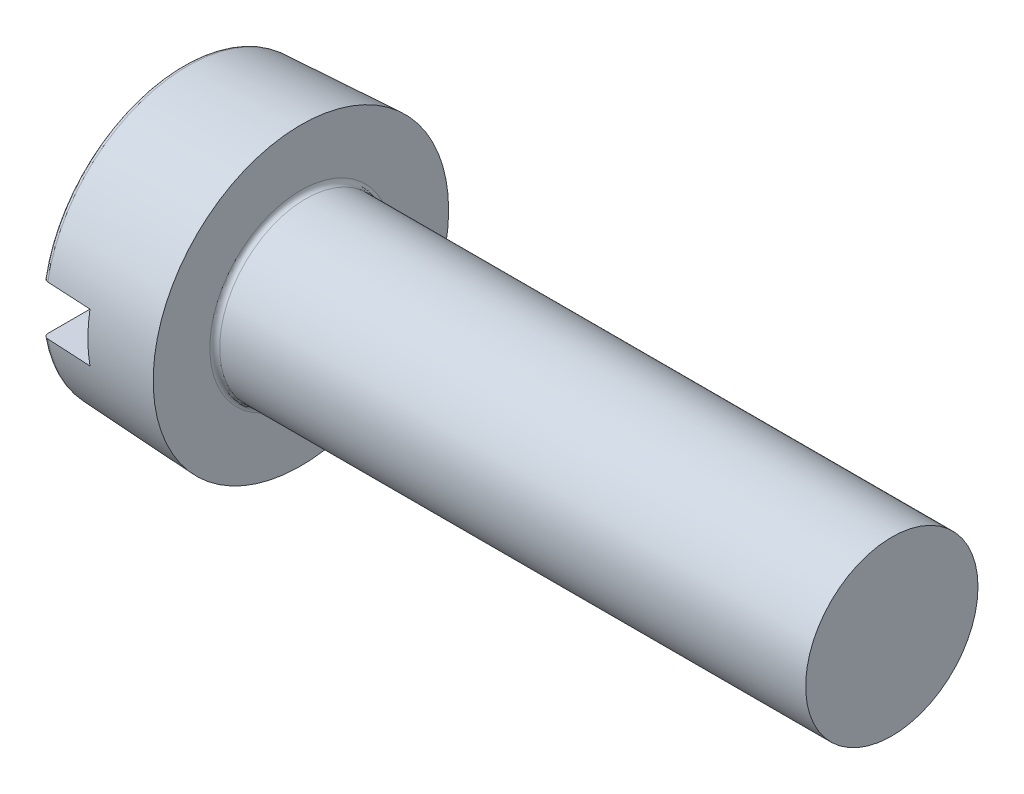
ISO-10303-21;
HEADER;
FILE_DESCRIPTION(('STEP AP214'),'2;1');
FILE_NAME('part.step','',(''),(''),'','','');
FILE_SCHEMA(('AUTOMOTIVE_DESIGN { 1 0 10303 214 1 1 1 1 }'));
ENDSEC;
DATA;
#1=APPLICATION_CONTEXT('core data for automotive mechanical design processes');
#2=APPLICATION_PROTOCOL_DEFINITION('international standard','automotive_design',2000,#1);
#3=PRODUCT_CONTEXT('',#1,'mechanical');
#4=PRODUCT('Part','Part','',(#3));
#5=PRODUCT_RELATED_PRODUCT_CATEGORY('part','',(#4));
#6=PRODUCT_DEFINITION_FORMATION('','',#4);
#7=PRODUCT_DEFINITION_CONTEXT('part definition',#1,'design');
#8=PRODUCT_DEFINITION('design','',#6,#7);
#9=PRODUCT_DEFINITION_SHAPE('','',#8);
#10=(LENGTH_UNIT() NAMED_UNIT(*) SI_UNIT(.MILLI.,.METRE.));
#11=(NAMED_UNIT(*) PLANE_ANGLE_UNIT() SI_UNIT($,.RADIAN.));
#12=(NAMED_UNIT(*) SI_UNIT($,.STERADIAN.) SOLID_ANGLE_UNIT());
#13=UNCERTAINTY_MEASURE_WITH_UNIT(LENGTH_MEASURE(1.E-05),#10,'distance_accuracy_value','');
#14=(GEOMETRIC_REPRESENTATION_CONTEXT(3) GLOBAL_UNCERTAINTY_ASSIGNED_CONTEXT((#13)) GLOBAL_UNIT_ASSIGNED_CONTEXT((#10,
#11,#12)) REPRESENTATION_CONTEXT('',''));
#15=CARTESIAN_POINT('',(0.,0.,0.));
#16=DIRECTION('',(0.,0.,1.));
#17=DIRECTION('',(1.,0.,0.));
#18=AXIS2_PLACEMENT_3D('',#15,#16,#17);
#19=CARTESIAN_POINT('',(0.,0.,0.));
#20=DIRECTION('',(1.,0.,0.));
#21=DIRECTION('',(0.,0.,-1.));
#22=AXIS2_PLACEMENT_3D('',#19,#20,#21);
#23=PLANE('',#22);
#24=DIRECTION('',(0.,0.,-1.));
#25=VECTOR('',#24,1.);
#26=CARTESIAN_POINT('',(0.,-0.5,0.));
#27=LINE('',#26,#25);
#28=CARTESIAN_POINT('',(0.,-0.5,2.7339800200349));
#29=VERTEX_POINT('',#28);
#30=CARTESIAN_POINT('',(0.,-0.5,-2.7339800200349));
#31=VERTEX_POINT('',#30);
#32=EDGE_CURVE('E117',#29,#31,#27,.T.);
#33=ORIENTED_EDGE('',*,*,#32,.T.);
#34=CARTESIAN_POINT('',(0.,0.,0.));
#35=DIRECTION('',(1.,0.,0.));
#36=DIRECTION('',(0.,0.,-1.));
#37=AXIS2_PLACEMENT_3D('',#34,#35,#36);
#38=CIRCLE('',#37,2.77932487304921);
#39=EDGE_CURVE('E199',#31,#29,#38,.F.);
#40=ORIENTED_EDGE('',*,*,#39,.T.);
#41=EDGE_LOOP('',(#33,#40));
#42=FACE_BOUND('',#41,.T.);
#43=ADVANCED_FACE('F37',(#42),#23,.F.);
#44=CARTESIAN_POINT('',(2.4,0.,0.));
#45=DIRECTION('',(1.,0.,0.));
#46=DIRECTION('',(0.,0.,-1.));
#47=AXIS2_PLACEMENT_3D('',#44,#45,#46);
#48=PLANE('',#47);
#49=CARTESIAN_POINT('',(2.4,0.,0.));
#50=DIRECTION('',(1.,0.,0.));
#51=DIRECTION('',(0.,0.,-1.));
#52=AXIS2_PLACEMENT_3D('',#49,#50,#51);
#53=CIRCLE('',#52,1.85);
#54=CARTESIAN_POINT('',(2.4,0.,-1.85));
#55=VERTEX_POINT('',#54);
#56=EDGE_CURVE('E127',#55,#55,#53,.F.);
#57=ORIENTED_EDGE('',*,*,#56,.T.);
#58=EDGE_LOOP('',(#57));
#59=FACE_BOUND('',#58,.T.);
#60=CARTESIAN_POINT('',(2.4,0.,0.));
#61=DIRECTION('',(1.,0.,0.));
#62=DIRECTION('',(0.,0.,-1.));
#63=AXIS2_PLACEMENT_3D('',#60,#61,#62);
#64=CIRCLE('',#63,3.);
#65=CARTESIAN_POINT('',(2.4,0.,-3.));
#66=VERTEX_POINT('',#65);
#67=EDGE_CURVE('E225',#66,#66,#64,.T.);
#68=ORIENTED_EDGE('',*,*,#67,.T.);
#69=EDGE_LOOP('',(#68));
#70=FACE_BOUND('',#69,.T.);
#71=ADVANCED_FACE('F176',(#59,#70),#48,.T.);
#72=CARTESIAN_POINT('',(2.4,0.,0.));
#73=DIRECTION('',(1.,0.,0.));
#74=DIRECTION('',(0.,0.,-1.));
#75=AXIS2_PLACEMENT_3D('',#72,#73,#74);
#76=CONICAL_SURFACE('',#75,3.,0.05235987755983);
#77=CARTESIAN_POINT('',(-5.03379648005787,-0.500000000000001,2.56207861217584));
#78=CARTESIAN_POINT('',(-3.20003342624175,-0.500000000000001,2.65996062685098));
#79=CARTESIAN_POINT('',(-1.36626239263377,-0.5,2.75769268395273));
#80=CARTESIAN_POINT('',(2.30129563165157,-0.499999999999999,2.95285688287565));
#81=CARTESIAN_POINT('',(4.13508262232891,-0.499999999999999,3.05028902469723));
#82=CARTESIAN_POINT('',(5.96887759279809,-0.499999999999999,3.14757120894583));
#83=B_SPLINE_CURVE_WITH_KNOTS('',3,(#77,#78,#79,#80,#81,#82),.UNSPECIFIED.,.F.,.F.,(4,2,4),(0.,
5.50912060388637,11.018241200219),.UNSPECIFIED.);
#84=CARTESIAN_POINT('',(0.0947664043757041,-0.5,2.83544044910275));
#85=VERTEX_POINT('',#84);
#86=CARTESIAN_POINT('',(1.,-0.5,2.88360155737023));
#87=VERTEX_POINT('',#86);
#88=EDGE_CURVE('E98',#85,#87,#83,.T.);
#89=ORIENTED_EDGE('',*,*,#88,.F.);
#90=CARTESIAN_POINT('',(0.0947664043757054,0.,0.));
#91=DIRECTION('',(1.,0.,0.));
#92=DIRECTION('',(0.,0.,-1.));
#93=AXIS2_PLACEMENT_3D('',#90,#91,#92);
#94=CIRCLE('',#93,2.87918782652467);
#95=CARTESIAN_POINT('',(0.0947664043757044,-0.5,-2.83544044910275));
#96=VERTEX_POINT('',#95);
#97=EDGE_CURVE('E132',#85,#96,#94,.T.);
#98=ORIENTED_EDGE('',*,*,#97,.T.);
#99=CARTESIAN_POINT('',(5.96887759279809,-0.499999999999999,-3.14757120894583));
#100=CARTESIAN_POINT('',(4.13508262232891,-0.499999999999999,-3.05028902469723));
#101=CARTESIAN_POINT('',(2.30129563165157,-0.499999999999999,-2.95285688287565));
#102=CARTESIAN_POINT('',(-1.36626239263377,-0.5,-2.75769268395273));
#103=CARTESIAN_POINT('',(-3.20003342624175,-0.500000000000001,-2.65996062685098));
#104=CARTESIAN_POINT('',(-5.03379648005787,-0.500000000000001,-2.56207861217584));
#105=B_SPLINE_CURVE_WITH_KNOTS('',3,(#99,#100,#101,#102,#103,#104),.UNSPECIFIED.,.F.,.F.,(4,2,
4),(0.,5.50912059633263,11.018241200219),.UNSPECIFIED.);
#106=CARTESIAN_POINT('',(1.,-0.5,-2.88360155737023));
#107=VERTEX_POINT('',#106);
#108=EDGE_CURVE('E116',#107,#96,#105,.T.);
#109=ORIENTED_EDGE('',*,*,#108,.F.);
#110=CARTESIAN_POINT('',(1.,0.,0.));
#111=DIRECTION('',(1.,0.,0.));
#112=DIRECTION('',(0.,0.,-1.));
#113=AXIS2_PLACEMENT_3D('',#110,#111,#112);
#114=CIRCLE('',#113,2.92662910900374);
#115=CARTESIAN_POINT('',(1.,0.5,-2.88360155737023));
#116=VERTEX_POINT('',#115);
#117=EDGE_CURVE('E104',#116,#107,#114,.F.);
#118=ORIENTED_EDGE('',*,*,#117,.F.);
#119=CARTESIAN_POINT('',(-5.03379648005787,0.499999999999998,-2.56207861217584));
#120=CARTESIAN_POINT('',(-3.20003342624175,0.499999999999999,-2.65996062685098));
#121=CARTESIAN_POINT('',(-1.36626239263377,0.499999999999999,-2.75769268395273));
#122=CARTESIAN_POINT('',(2.30129563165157,0.500000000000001,-2.95285688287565));
#123=CARTESIAN_POINT('',(4.13508262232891,0.500000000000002,-3.05028902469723));
#124=CARTESIAN_POINT('',(5.96887759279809,0.500000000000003,-3.14757120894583));
#125=B_SPLINE_CURVE_WITH_KNOTS('',3,(#119,#120,#121,#122,#123,#124),.UNSPECIFIED.,.F.,.F.,(4,2,
4),(0.,5.50912060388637,11.018241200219),.UNSPECIFIED.);
#126=CARTESIAN_POINT('',(0.0947664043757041,0.5,-2.83544044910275));
#127=VERTEX_POINT('',#126);
#128=EDGE_CURVE('E87',#127,#116,#125,.T.);
#129=ORIENTED_EDGE('',*,*,#128,.F.);
#130=CARTESIAN_POINT('',(0.0947664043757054,0.,0.));
#131=DIRECTION('',(1.,0.,0.));
#132=DIRECTION('',(0.,0.,-1.));
#133=AXIS2_PLACEMENT_3D('',#130,#131,#132);
#134=CIRCLE('',#133,2.87918782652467);
#135=CARTESIAN_POINT('',(0.0947664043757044,0.5,2.83544044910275));
#136=VERTEX_POINT('',#135);
#137=EDGE_CURVE('E130',#127,#136,#134,.T.);
#138=ORIENTED_EDGE('',*,*,#137,.T.);
#139=CARTESIAN_POINT('',(5.96887759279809,0.500000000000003,3.14757120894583));
#140=CARTESIAN_POINT('',(4.13508262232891,0.500000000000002,3.05028902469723));
#141=CARTESIAN_POINT('',(2.30129563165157,0.500000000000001,2.95285688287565));
#142=CARTESIAN_POINT('',(-1.36626239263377,0.499999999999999,2.75769268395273));
#143=CARTESIAN_POINT('',(-3.20003342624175,0.499999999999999,2.65996062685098));
#144=CARTESIAN_POINT('',(-5.03379648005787,0.499999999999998,2.56207861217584));
#145=B_SPLINE_CURVE_WITH_KNOTS('',3,(#139,#140,#141,#142,#143,#144),.UNSPECIFIED.,.F.,.F.,(4,2,
4),(0.,5.50912059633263,11.018241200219),.UNSPECIFIED.);
#146=CARTESIAN_POINT('',(1.,0.5,2.88360155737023));
#147=VERTEX_POINT('',#146);
#148=EDGE_CURVE('E99',#147,#136,#145,.T.);
#149=ORIENTED_EDGE('',*,*,#148,.F.);
#150=EDGE_CURVE('E107',#87,#147,#114,.F.);
#151=ORIENTED_EDGE('',*,*,#150,.F.);
#152=EDGE_LOOP('',(#89,#98,#109,#118,#129,#138,#149,#151));
#153=FACE_BOUND('',#152,.T.);
#154=ORIENTED_EDGE('',*,*,#67,.F.);
#155=EDGE_LOOP('',(#154));
#156=FACE_BOUND('',#155,.T.);
#157=ADVANCED_FACE('F112',(#153,#156),#76,.T.);
#158=DIRECTION('',(0.,0.,1.));
#159=VECTOR('',#158,1.);
#160=CARTESIAN_POINT('',(0.,0.5,0.));
#161=LINE('',#160,#159);
#162=CARTESIAN_POINT('',(0.,0.5,-2.7339800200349));
#163=VERTEX_POINT('',#162);
#164=CARTESIAN_POINT('',(0.,0.5,2.7339800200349));
#165=VERTEX_POINT('',#164);
#166=EDGE_CURVE('E121',#163,#165,#161,.T.);
#167=ORIENTED_EDGE('',*,*,#166,.T.);
#168=CARTESIAN_POINT('',(0.,0.,0.));
#169=DIRECTION('',(1.,0.,0.));
#170=DIRECTION('',(0.,0.,-1.));
#171=AXIS2_PLACEMENT_3D('',#168,#169,#170);
#172=CIRCLE('',#171,2.77932487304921);
#173=EDGE_CURVE('E11',#165,#163,#172,.F.);
#174=ORIENTED_EDGE('',*,*,#173,.T.);
#175=EDGE_LOOP('',(#167,#174));
#176=FACE_BOUND('',#175,.T.);
#177=ADVANCED_FACE('F175',(#176),#23,.F.);
#178=CARTESIAN_POINT('',(14.3999999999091,0.,0.));
#179=DIRECTION('',(-1.,0.,0.));
#180=DIRECTION('',(0.,0.,1.));
#181=AXIS2_PLACEMENT_3D('',#178,#179,#180);
#182=CYLINDRICAL_SURFACE('',#181,1.75);
#183=CARTESIAN_POINT('',(2.5,0.,0.));
#184=DIRECTION('',(1.,0.,0.));
#185=DIRECTION('',(0.,0.,-1.));
#186=AXIS2_PLACEMENT_3D('',#183,#184,#185);
#187=CIRCLE('',#186,1.75);
#188=CARTESIAN_POINT('',(2.5,0.,-1.75));
#189=VERTEX_POINT('',#188);
#190=EDGE_CURVE('E119',#189,#189,#187,.T.);
#191=ORIENTED_EDGE('',*,*,#190,.T.);
#192=EDGE_LOOP('',(#191));
#193=FACE_BOUND('',#192,.T.);
#194=CARTESIAN_POINT('',(14.3999999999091,0.,0.));
#195=DIRECTION('',(1.,0.,0.));
#196=DIRECTION('',(0.,0.,-1.));
#197=AXIS2_PLACEMENT_3D('',#194,#195,#196);
#198=CIRCLE('',#197,1.75);
#199=CARTESIAN_POINT('',(14.3999999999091,0.,-1.75));
#200=VERTEX_POINT('',#199);
#201=EDGE_CURVE('E170',#200,#200,#198,.T.);
#202=ORIENTED_EDGE('',*,*,#201,.F.);
#203=EDGE_LOOP('',(#202));
#204=FACE_BOUND('',#203,.T.);
#205=ADVANCED_FACE('F220',(#193,#204),#182,.T.);
#206=CARTESIAN_POINT('',(14.3999999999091,0.,0.));
#207=DIRECTION('',(1.,0.,0.));
#208=DIRECTION('',(0.,0.,-1.));
#209=AXIS2_PLACEMENT_3D('',#206,#207,#208);
#210=PLANE('',#209);
#211=ORIENTED_EDGE('',*,*,#201,.T.);
#212=EDGE_LOOP('',(#211));
#213=FACE_BOUND('',#212,.T.);
#214=ADVANCED_FACE('F153',(#213),#210,.T.);
#215=CARTESIAN_POINT('',(0.,-0.5,-3.));
#216=DIRECTION('',(0.,-1.,0.));
#217=DIRECTION('',(1.,0.,0.));
#218=AXIS2_PLACEMENT_3D('',#215,#216,#217);
#219=PLANE('',#218);
#220=ORIENTED_EDGE('',*,*,#108,.T.);
#221=CARTESIAN_POINT('',(0.0947664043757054,-0.5,-2.83544044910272));
#222=CARTESIAN_POINT('',(0.0892037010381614,-0.5,-2.8351495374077));
#223=CARTESIAN_POINT('',(0.0836686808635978,-0.5,-2.83437697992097));
#224=CARTESIAN_POINT('',(0.0728128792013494,-0.5,-2.83191620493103));
#225=CARTESIAN_POINT('',(0.0674918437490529,-0.5,-2.83022910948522));
#226=CARTESIAN_POINT('',(0.057206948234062,-0.5,-2.8259853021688));
#227=CARTESIAN_POINT('',(0.0522431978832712,-0.5,-2.82342832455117));
#228=CARTESIAN_POINT('',(0.0428116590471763,-0.5,-2.81752383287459));
#229=CARTESIAN_POINT('',(0.0383438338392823,-0.5,-2.81417637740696));
#230=CARTESIAN_POINT('',(0.0299931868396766,-0.5,-2.8067617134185));
#231=CARTESIAN_POINT('',(0.0261148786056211,-0.5,-2.80268942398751));
#232=CARTESIAN_POINT('',(0.0190838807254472,-0.5,-2.79395863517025));
#233=CARTESIAN_POINT('',(0.0159314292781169,-0.5,-2.78929994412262));
#234=CARTESIAN_POINT('',(0.0103922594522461,-0.5,-2.77945487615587));
#235=CARTESIAN_POINT('',(0.00801788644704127,-0.5,-2.77426156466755));
#236=CARTESIAN_POINT('',(0.00416302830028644,-0.5,-2.7635554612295));
#237=CARTESIAN_POINT('',(0.00268185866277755,-0.5,-2.75804291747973));
#238=CARTESIAN_POINT('',(0.00111040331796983,-0.5,-2.74940205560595));
#239=CARTESIAN_POINT('',(0.00069391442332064,-0.5,-2.74632955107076));
#240=CARTESIAN_POINT('',(0.000138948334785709,-0.5,-2.74016513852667));
#241=CARTESIAN_POINT('',(-3.07996439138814E-08,-0.5,-2.73707327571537));
#242=CARTESIAN_POINT('',(0.,-0.5,-2.7339800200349));
#243=B_SPLINE_CURVE_WITH_KNOTS('',3,(#221,#222,#223,#224,#225,#226,#227,#228,#229,#230,#231,
#232,#233,#234,#235,#236,#237,#238,#239,#240,#241,#242),.UNSPECIFIED.,.F.,.F.,(4,2,2,2,2,2,2,2,
2,2,4),(0.,0.0166874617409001,0.0333544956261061,0.0500266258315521,0.0666975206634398,
0.0834902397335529,0.100288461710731,0.117341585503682,0.134381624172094,0.14367231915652,
0.152946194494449),.UNSPECIFIED.);
#244=EDGE_CURVE('E140',#96,#31,#243,.T.);
#245=ORIENTED_EDGE('',*,*,#244,.T.);
#246=ORIENTED_EDGE('',*,*,#32,.F.);
#247=CARTESIAN_POINT('',(0.,-0.5,2.7339800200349));
#248=CARTESIAN_POINT('',(-4.48427181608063E-06,-0.5,2.73976430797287));
#249=CARTESIAN_POINT('',(0.00048537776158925,-0.5,2.74554780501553));
#250=CARTESIAN_POINT('',(0.00242211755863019,-0.5,2.75695087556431));
#251=CARTESIAN_POINT('',(0.00386875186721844,-0.5,2.76257049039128));
#252=CARTESIAN_POINT('',(0.00768866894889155,-0.5,2.7734902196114));
#253=CARTESIAN_POINT('',(0.010062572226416,-0.5,2.77879011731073));
#254=CARTESIAN_POINT('',(0.0156724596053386,-0.5,2.78891006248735));
#255=CARTESIAN_POINT('',(0.0189081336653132,-0.5,2.79373028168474));
#256=CARTESIAN_POINT('',(0.026125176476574,-0.5,2.80271206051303));
#257=CARTESIAN_POINT('',(0.030100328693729,-0.5,2.80687861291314));
#258=CARTESIAN_POINT('',(0.0387049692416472,-0.5,2.8144741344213));
#259=CARTESIAN_POINT('',(0.043334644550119,-0.5,2.81790289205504));
#260=CARTESIAN_POINT('',(0.0530411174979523,-0.5,2.82386903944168));
#261=CARTESIAN_POINT('',(0.0581102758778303,-0.5,2.8264188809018));
#262=CARTESIAN_POINT('',(0.0686061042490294,-0.5,2.83061527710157));
#263=CARTESIAN_POINT('',(0.0740323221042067,-0.5,2.8322629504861));
#264=CARTESIAN_POINT('',(0.0820605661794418,-0.5,2.83396630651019));
#265=CARTESIAN_POINT('',(0.0845874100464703,-0.5,2.83440004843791));
#266=CARTESIAN_POINT('',(0.0896628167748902,-0.5,2.83506893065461));
#267=CARTESIAN_POINT('',(0.0922113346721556,-0.5,2.83530441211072));
#268=CARTESIAN_POINT('',(0.0947664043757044,-0.5,2.83544044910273));
#269=B_SPLINE_CURVE_WITH_KNOTS('',3,(#247,#248,#249,#250,#251,#252,#253,#254,#255,#256,#257,
#258,#259,#260,#261,#262,#263,#264,#265,#266,#267,#268),.UNSPECIFIED.,.F.,.F.,(4,2,2,2,2,2,2,2,
2,2,4),(0.,0.017331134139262,0.0346578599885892,0.0519962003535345,0.069328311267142,
0.0865208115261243,0.103718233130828,0.120660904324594,0.137582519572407,0.145267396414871,
0.152939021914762),.UNSPECIFIED.);
#270=EDGE_CURVE('E134',#29,#85,#269,.T.);
#271=ORIENTED_EDGE('',*,*,#270,.T.);
#272=ORIENTED_EDGE('',*,*,#88,.T.);
#273=DIRECTION('',(0.,0.,1.));
#274=VECTOR('',#273,1.);
#275=CARTESIAN_POINT('',(1.,-0.5,-3.));
#276=LINE('',#275,#274);
#277=EDGE_CURVE('E108',#107,#87,#276,.T.);
#278=ORIENTED_EDGE('',*,*,#277,.F.);
#279=EDGE_LOOP('',(#220,#245,#246,#271,#272,#278));
#280=FACE_BOUND('',#279,.T.);
#281=ADVANCED_FACE('F148',(#280),#219,.F.);
#282=CARTESIAN_POINT('',(0.,0.5,-3.));
#283=DIRECTION('',(0.,1.,0.));
#284=DIRECTION('',(-1.,0.,0.));
#285=AXIS2_PLACEMENT_3D('',#282,#283,#284);
#286=PLANE('',#285);
#287=ORIENTED_EDGE('',*,*,#148,.T.);
#288=CARTESIAN_POINT('',(0.0947664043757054,0.5,2.83544044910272));
#289=CARTESIAN_POINT('',(0.0892037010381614,0.5,2.8351495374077));
#290=CARTESIAN_POINT('',(0.0836686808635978,0.5,2.83437697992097));
#291=CARTESIAN_POINT('',(0.0728128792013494,0.5,2.83191620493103));
#292=CARTESIAN_POINT('',(0.0674918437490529,0.5,2.83022910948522));
#293=CARTESIAN_POINT('',(0.057206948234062,0.5,2.8259853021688));
#294=CARTESIAN_POINT('',(0.0522431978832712,0.5,2.82342832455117));
#295=CARTESIAN_POINT('',(0.0428116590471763,0.5,2.81752383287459));
#296=CARTESIAN_POINT('',(0.0383438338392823,0.5,2.81417637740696));
#297=CARTESIAN_POINT('',(0.0299931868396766,0.5,2.8067617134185));
#298=CARTESIAN_POINT('',(0.0261148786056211,0.5,2.80268942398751));
#299=CARTESIAN_POINT('',(0.0190838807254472,0.5,2.79395863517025));
#300=CARTESIAN_POINT('',(0.0159314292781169,0.5,2.78929994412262));
#301=CARTESIAN_POINT('',(0.0103922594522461,0.5,2.77945487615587));
#302=CARTESIAN_POINT('',(0.00801788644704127,0.5,2.77426156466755));
#303=CARTESIAN_POINT('',(0.00416302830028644,0.5,2.7635554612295));
#304=CARTESIAN_POINT('',(0.00268185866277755,0.5,2.75804291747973));
#305=CARTESIAN_POINT('',(0.00111040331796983,0.5,2.74940205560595));
#306=CARTESIAN_POINT('',(0.000693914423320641,0.5,2.74632955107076));
#307=CARTESIAN_POINT('',(0.00013894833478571,0.5,2.74016513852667));
#308=CARTESIAN_POINT('',(-3.07996439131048E-08,0.5,2.73707327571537));
#309=CARTESIAN_POINT('',(0.,0.5,2.7339800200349));
#310=B_SPLINE_CURVE_WITH_KNOTS('',3,(#288,#289,#290,#291,#292,#293,#294,#295,#296,#297,#298,
#299,#300,#301,#302,#303,#304,#305,#306,#307,#308,#309),.UNSPECIFIED.,.F.,.F.,(4,2,2,2,2,2,2,2,
2,2,4),(0.,0.0166874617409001,0.0333544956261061,0.0500266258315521,0.0666975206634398,
0.0834902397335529,0.100288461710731,0.117341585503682,0.134381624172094,0.14367231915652,
0.152946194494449),.UNSPECIFIED.);
#311=EDGE_CURVE('E46',#136,#165,#310,.T.);
#312=ORIENTED_EDGE('',*,*,#311,.T.);
#313=ORIENTED_EDGE('',*,*,#166,.F.);
#314=CARTESIAN_POINT('',(0.,0.5,-2.7339800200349));
#315=CARTESIAN_POINT('',(-4.48427181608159E-06,0.5,-2.73976430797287));
#316=CARTESIAN_POINT('',(0.000485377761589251,0.5,-2.74554780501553));
#317=CARTESIAN_POINT('',(0.00242211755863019,0.5,-2.75695087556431));
#318=CARTESIAN_POINT('',(0.00386875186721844,0.5,-2.76257049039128));
#319=CARTESIAN_POINT('',(0.00768866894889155,0.5,-2.7734902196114));
#320=CARTESIAN_POINT('',(0.010062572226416,0.5,-2.77879011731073));
#321=CARTESIAN_POINT('',(0.0156724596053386,0.5,-2.78891006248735));
#322=CARTESIAN_POINT('',(0.0189081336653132,0.5,-2.79373028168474));
#323=CARTESIAN_POINT('',(0.026125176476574,0.5,-2.80271206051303));
#324=CARTESIAN_POINT('',(0.030100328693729,0.5,-2.80687861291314));
#325=CARTESIAN_POINT('',(0.0387049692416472,0.5,-2.8144741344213));
#326=CARTESIAN_POINT('',(0.043334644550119,0.5,-2.81790289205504));
#327=CARTESIAN_POINT('',(0.0530411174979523,0.5,-2.82386903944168));
#328=CARTESIAN_POINT('',(0.0581102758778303,0.5,-2.8264188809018));
#329=CARTESIAN_POINT('',(0.0686061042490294,0.5,-2.83061527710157));
#330=CARTESIAN_POINT('',(0.0740323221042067,0.5,-2.8322629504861));
#331=CARTESIAN_POINT('',(0.0820605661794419,0.5,-2.83396630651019));
#332=CARTESIAN_POINT('',(0.0845874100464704,0.5,-2.83440004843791));
#333=CARTESIAN_POINT('',(0.0896628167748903,0.5,-2.83506893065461));
#334=CARTESIAN_POINT('',(0.0922113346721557,0.5,-2.83530441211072));
#335=CARTESIAN_POINT('',(0.0947664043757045,0.5,-2.83544044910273));
#336=B_SPLINE_CURVE_WITH_KNOTS('',3,(#314,#315,#316,#317,#318,#319,#320,#321,#322,#323,#324,
#325,#326,#327,#328,#329,#330,#331,#332,#333,#334,#335),.UNSPECIFIED.,.F.,.F.,(4,2,2,2,2,2,2,2,
2,2,4),(0.,0.017331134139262,0.0346578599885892,0.0519962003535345,0.069328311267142,
0.0865208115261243,0.103718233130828,0.120660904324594,0.137582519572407,0.145267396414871,
0.152939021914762),.UNSPECIFIED.);
#337=EDGE_CURVE('E93',#163,#127,#336,.T.);
#338=ORIENTED_EDGE('',*,*,#337,.T.);
#339=ORIENTED_EDGE('',*,*,#128,.T.);
#340=DIRECTION('',(0.,0.,1.));
#341=VECTOR('',#340,1.);
#342=CARTESIAN_POINT('',(1.,0.5,-3.));
#343=LINE('',#342,#341);
#344=EDGE_CURVE('E90',#116,#147,#343,.T.);
#345=ORIENTED_EDGE('',*,*,#344,.T.);
#346=EDGE_LOOP('',(#287,#312,#313,#338,#339,#345));
#347=FACE_BOUND('',#346,.T.);
#348=ADVANCED_FACE('F89',(#347),#286,.F.);
#349=CARTESIAN_POINT('',(1.,-0.5,-3.));
#350=DIRECTION('',(1.,0.,0.));
#351=DIRECTION('',(0.,0.,-1.));
#352=AXIS2_PLACEMENT_3D('',#349,#350,#351);
#353=PLANE('',#352);
#354=ORIENTED_EDGE('',*,*,#150,.T.);
#355=ORIENTED_EDGE('',*,*,#344,.F.);
#356=ORIENTED_EDGE('',*,*,#117,.T.);
#357=ORIENTED_EDGE('',*,*,#277,.T.);
#358=EDGE_LOOP('',(#354,#355,#356,#357));
#359=FACE_BOUND('',#358,.T.);
#360=ADVANCED_FACE('F102',(#359),#353,.F.);
#361=CARTESIAN_POINT('',(2.5,0.,0.));
#362=DIRECTION('',(1.,0.,0.));
#363=DIRECTION('',(0.,0.,-1.));
#364=AXIS2_PLACEMENT_3D('',#361,#362,#363);
#365=TOROIDAL_SURFACE('',#364,1.85,0.1);
#366=ORIENTED_EDGE('',*,*,#56,.F.);
#367=EDGE_LOOP('',(#366));
#368=FACE_BOUND('',#367,.T.);
#369=ORIENTED_EDGE('',*,*,#190,.F.);
#370=EDGE_LOOP('',(#369));
#371=FACE_BOUND('',#370,.T.);
#372=ADVANCED_FACE('F178',(#368,#371),#365,.F.);
#373=CARTESIAN_POINT('',(0.0999999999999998,0.,0.));
#374=DIRECTION('',(1.,0.,0.));
#375=DIRECTION('',(0.,0.,-1.));
#376=AXIS2_PLACEMENT_3D('',#373,#374,#375);
#377=TOROIDAL_SURFACE('',#376,2.77932487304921,0.1);
#378=ORIENTED_EDGE('',*,*,#270,.F.);
#379=ORIENTED_EDGE('',*,*,#39,.F.);
#380=ORIENTED_EDGE('',*,*,#244,.F.);
#381=ORIENTED_EDGE('',*,*,#97,.F.);
#382=EDGE_LOOP('',(#378,#379,#380,#381));
#383=FACE_BOUND('',#382,.T.);
#384=ADVANCED_FACE('F145',(#383),#377,.T.);
#385=CARTESIAN_POINT('',(0.0999999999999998,0.,0.));
#386=DIRECTION('',(1.,0.,0.));
#387=DIRECTION('',(0.,0.,-1.));
#388=AXIS2_PLACEMENT_3D('',#385,#386,#387);
#389=TOROIDAL_SURFACE('',#388,2.77932487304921,0.1);
#390=ORIENTED_EDGE('',*,*,#337,.F.);
#391=ORIENTED_EDGE('',*,*,#173,.F.);
#392=ORIENTED_EDGE('',*,*,#311,.F.);
#393=ORIENTED_EDGE('',*,*,#137,.F.);
#394=EDGE_LOOP('',(#390,#391,#392,#393));
#395=FACE_BOUND('',#394,.T.);
#396=ADVANCED_FACE('F39',(#395),#389,.T.);
#397=CLOSED_SHELL('',(#43,#71,#157,#177,#205,#214,#281,#348,#360,#372,#384,#396));
#398=MANIFOLD_SOLID_BREP('B2',#397);
#399=ADVANCED_BREP_SHAPE_REPRESENTATION('',(#18,#398),#14);
#400=SHAPE_DEFINITION_REPRESENTATION(#9,#399);
ENDSEC;
END-ISO-10303-21;
